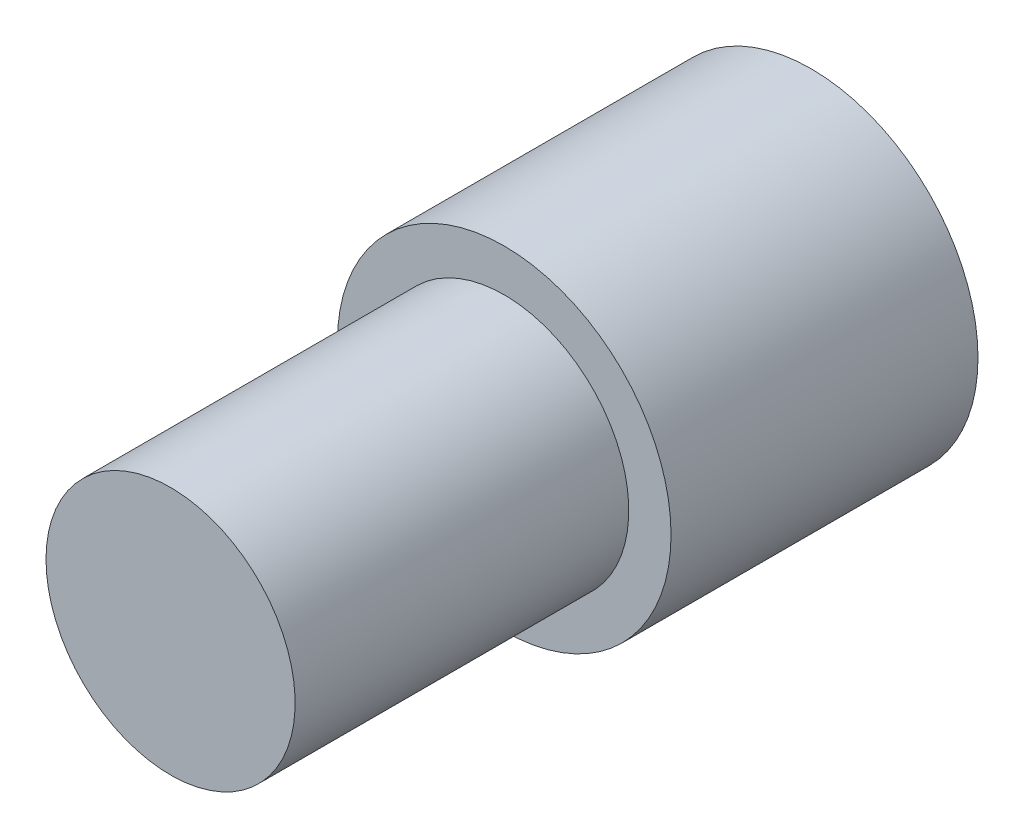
from build123d import *

# Parameters (mm, degrees)
SKETCH1_R           = 9.525
BOSS_EXTRUDE1_DEPTH = 17.526
SKETCH2_R           = 7.112
BOSS_EXTRUDE2_DEPTH = 19.05


with BuildPart() as part:
    # Sketch1 → Boss-Extrude1 (new body)
    with BuildSketch(Plane.XY):
        Circle(SKETCH1_R)
    extrude(amount=BOSS_EXTRUDE1_DEPTH)

    # Sketch2 → Boss-Extrude2 (add)
    with BuildSketch(Plane.XY.offset(17.526)):
        with Locations(Location((0, 0, 0), (0, 0, 180))):
            Circle(SKETCH2_R)
    extrude(amount=BOSS_EXTRUDE2_DEPTH)


solid = part.part
